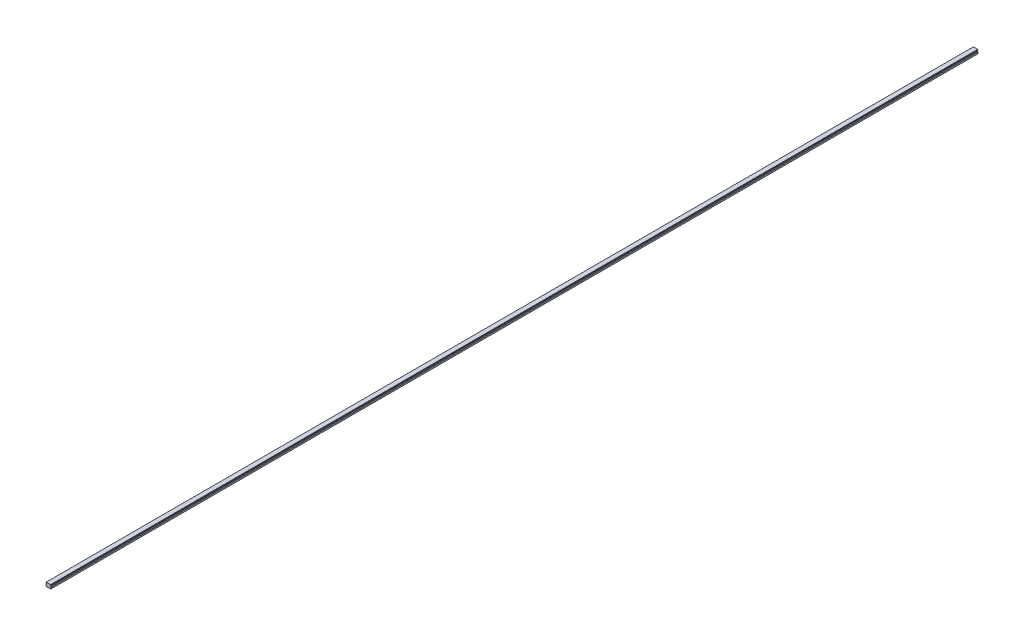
from build123d import *

# Parameters (mm, degrees)
SKETCH1_W           = 20
SKETCH1_H           = 16.3
BOSS_EXTRUDE1_DEPTH = 1910
CUT_EXTRUDE1_DEPTH  = 3821.047864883
CHAMFER1_SIZE       = 1
FILLET1_R           = 1
CUT_EXTRUDE2_DEPTH  = 3821.047864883
SKETCH5_R           = 3
SKETCH5_R_2         = 2.5
CUT_EXTRUDE5_DEPTH  = 10
SKETCH5_2_R         = 2.5
CUT_EXTRUDE6_DEPTH  = 13
LPATTERN2_COUNT     = 64
LPATTERN2_PITCH     = 60


with BuildPart() as part:
    # Sketch1 → Boss-Extrude1 (new, symmetric)
    with BuildSketch(Plane.XY):
        with Locations((0, 8.15)):
            Rectangle(SKETCH1_W, SKETCH1_H)
    extrude(amount=BOSS_EXTRUDE1_DEPTH, both=True)

    # Sketch2 → Cut-Extrude1 (cut, through all)
    with BuildSketch(Plane.XY.offset(1910)):
        Polygon((-10, 14.3), (-10, 7.3), (-7.666666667, 9.633333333), (-7.666666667, 11.966666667), align=None)
        Polygon((7.666666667, 11.966666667), (10, 14.3), (10, 7.3), (7.666666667, 9.633333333), align=None)
    extrude(amount=-CUT_EXTRUDE1_DEPTH, mode=Mode.SUBTRACT)

    # Chamfer1
    chamfer1_edges = [part.edges().sort_by_distance(p)[0] for p in [
        (-10, 16.3, 0),
        (10, 16.3, 0),
        (10, 0, 0),
        (-10, 0, 0),
    ]]
    chamfer(chamfer1_edges, length=CHAMFER1_SIZE)

    # Fillet1
    fillet1_edges = [part.edges().sort_by_distance(p)[0] for p in [
        (-7.666666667, 11.966666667, 0),
        (-7.666666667, 9.633333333, 0),
        (7.666666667, 9.633333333, 0),
        (7.666666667, 11.966666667, 0),
    ]]
    fillet(fillet1_edges, radius=FILLET1_R)

    # Sketch3 → Cut-Extrude2 (cut, through all)
    with BuildSketch(Plane.XY.offset(1910)):
        Polygon((-6, 0), (-5, 1), (5, 1), (6, 0), align=None)
    extrude(amount=-CUT_EXTRUDE2_DEPTH, mode=Mode.SUBTRACT)

    # Sketch5 → Cut-Extrude5 (cut)
    with BuildSketch(Plane.XZ.offset(-1)):
        with Locations(Location((0, 1890, 0), (0, 0, 270))):
            Circle(SKETCH5_R)
        with Locations(Location((0, 1890, 0), (0, 0, 270))):
            Circle(SKETCH5_R_2, mode=Mode.SUBTRACT)
    cut_extrude5 = extrude(amount=-CUT_EXTRUDE5_DEPTH, mode=Mode.SUBTRACT)

    # Sketch5_2 → Cut-Extrude6 (cut)
    with BuildSketch(Plane.XZ.offset(-1)):
        with Locations(Location((0, 1890, 0), (0, 0, 270))):
            Circle(SKETCH5_2_R)
    cut_extrude6 = extrude(amount=-CUT_EXTRUDE6_DEPTH, mode=Mode.SUBTRACT)

    # Cut-Extrude7 cone 1 section (on through the dimple's axis) → Cut-Extrude7 (revolve, cut)
    with BuildSketch(Plane(origin=(0, 14, 1890), x_dir=(0, 0, -1), z_dir=(1, 0, 0))):
        Polygon((0, 0), (2.5, 0), (0, 1.443375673), align=None)
    cut_extrude7 = revolve(axis=Axis((0, 14, 1890), (0, 1, 0)), mode=Mode.SUBTRACT)

    # LPattern2: Cut-Extrude5, Cut-Extrude6, Cut-Extrude7 ×64
    with Locations(*[(0, 0, -i * LPATTERN2_PITCH) for i in range(1, LPATTERN2_COUNT)]):
        add(cut_extrude5, mode=Mode.SUBTRACT)
        add(cut_extrude6, mode=Mode.SUBTRACT)
        add(cut_extrude7, mode=Mode.SUBTRACT)


solid = part.part
